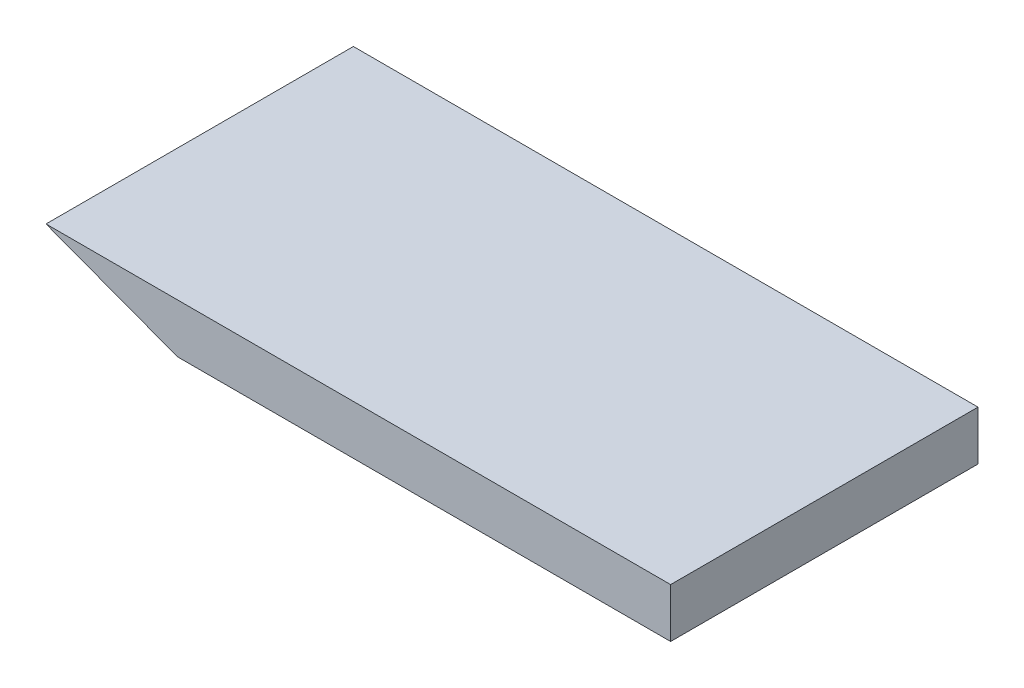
from build123d import *

# Parameters (mm, degrees)
SKETCH1_W               = 38
SKETCH1_H               = 18.7
BOSS_EXTRUDE1_DEPTH     = 3
CUT_EXTRUDE1_DEPTH      = 27.827038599
CUT_EXTRUDE1_DEPTH_BACK = 27.827038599


with BuildPart() as part:
    # Sketch1 → Boss-Extrude1 (new body)
    with BuildSketch(Plane(origin=(0, 0, 0), x_dir=(1, 0, 0), z_dir=(0, 1, 0))):
        Rectangle(SKETCH1_W, SKETCH1_H)
    extrude(amount=BOSS_EXTRUDE1_DEPTH)

    # Sketch2 → Cut-Extrude1 (cut, two sides: drawn at the far end of the back side and taken through both)
    with BuildSketch(Plane.XY.offset(9.35).offset(-CUT_EXTRUDE1_DEPTH_BACK)):
        Polygon((-19, 3), (-19, 0), (-11, 0), align=None)
    extrude(amount=CUT_EXTRUDE1_DEPTH + CUT_EXTRUDE1_DEPTH_BACK, mode=Mode.SUBTRACT)


solid = part.part
